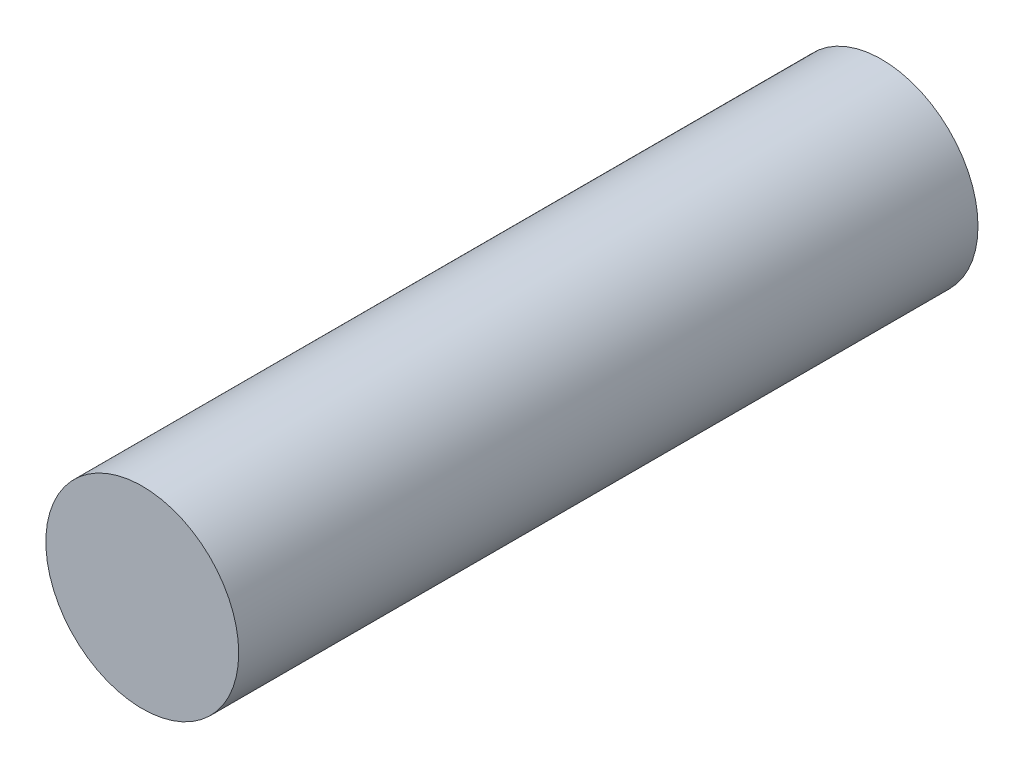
from build123d import *

# Parameters (mm, degrees)
SKETCH1_R                  = 15
BOSS_EXTRUDE1_DEPTH        = 115
F_25_0MM_DOWEL_HOLE9_D     = 29
F_25_0MM_DOWEL_HOLE9_DEPTH = 105.8
F_25_0MM_DOWEL_HOLE9_TIP   = 8.712478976


with BuildPart() as part:
    # Sketch1 → Boss-Extrude1 (new body)
    with BuildSketch(Plane.XY):
        Circle(SKETCH1_R)
    extrude(amount=BOSS_EXTRUDE1_DEPTH)

    # 25.0mm Dowel Hole9
    with Locations(Plane(origin=(0, 0, 0), x_dir=(-1, 0, 0), z_dir=(0, 0, -1))):
        with Locations((0, 0)):
            Hole(F_25_0MM_DOWEL_HOLE9_D / 2, depth=F_25_0MM_DOWEL_HOLE9_DEPTH)
            with Locations((0, 0, -(F_25_0MM_DOWEL_HOLE9_DEPTH + F_25_0MM_DOWEL_HOLE9_TIP / 2))):  # 118° drill point
                Cone(0, F_25_0MM_DOWEL_HOLE9_D / 2, F_25_0MM_DOWEL_HOLE9_TIP, mode=Mode.SUBTRACT)


solid = part.part
